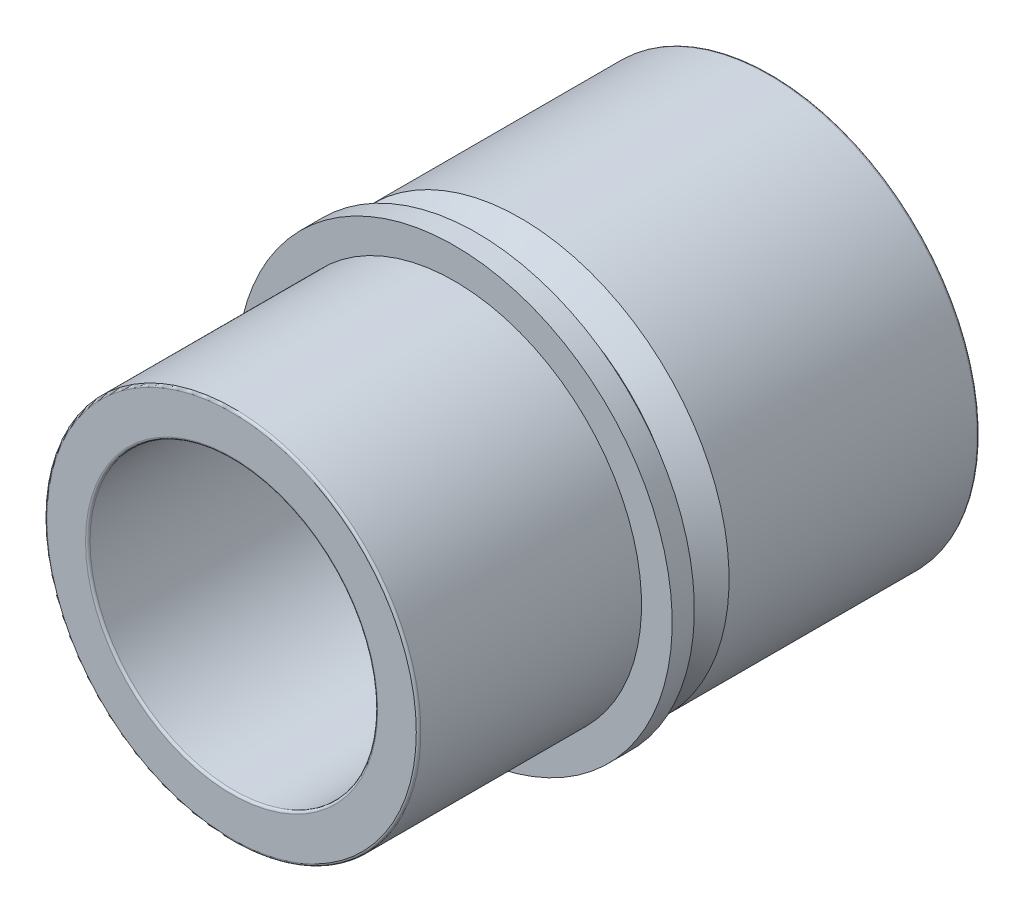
ISO-10303-21;
HEADER;
FILE_DESCRIPTION(('STEP AP214'),'2;1');
FILE_NAME('part.step','',(''),(''),'','','');
FILE_SCHEMA(('AUTOMOTIVE_DESIGN { 1 0 10303 214 1 1 1 1 }'));
ENDSEC;
DATA;
#1=APPLICATION_CONTEXT('core data for automotive mechanical design processes');
#2=APPLICATION_PROTOCOL_DEFINITION('international standard','automotive_design',2000,#1);
#3=PRODUCT_CONTEXT('',#1,'mechanical');
#4=PRODUCT('Part','Part','',(#3));
#5=PRODUCT_RELATED_PRODUCT_CATEGORY('part','',(#4));
#6=PRODUCT_DEFINITION_FORMATION('','',#4);
#7=PRODUCT_DEFINITION_CONTEXT('part definition',#1,'design');
#8=PRODUCT_DEFINITION('design','',#6,#7);
#9=PRODUCT_DEFINITION_SHAPE('','',#8);
#10=(LENGTH_UNIT() NAMED_UNIT(*) SI_UNIT(.MILLI.,.METRE.));
#11=(NAMED_UNIT(*) PLANE_ANGLE_UNIT() SI_UNIT($,.RADIAN.));
#12=(NAMED_UNIT(*) SI_UNIT($,.STERADIAN.) SOLID_ANGLE_UNIT());
#13=UNCERTAINTY_MEASURE_WITH_UNIT(LENGTH_MEASURE(1.E-05),#10,'distance_accuracy_value','');
#14=(GEOMETRIC_REPRESENTATION_CONTEXT(3) GLOBAL_UNCERTAINTY_ASSIGNED_CONTEXT((#13)) GLOBAL_UNIT_ASSIGNED_CONTEXT((#10,
#11,#12)) REPRESENTATION_CONTEXT('',''));
#15=CARTESIAN_POINT('',(0.,0.,0.));
#16=DIRECTION('',(0.,0.,1.));
#17=DIRECTION('',(1.,0.,0.));
#18=AXIS2_PLACEMENT_3D('',#15,#16,#17);
#19=CARTESIAN_POINT('',(0.,0.,-9.80439999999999));
#20=DIRECTION('',(0.,0.,-1.));
#21=DIRECTION('',(-1.,0.,0.));
#22=AXIS2_PLACEMENT_3D('',#19,#20,#21);
#23=CONICAL_SURFACE('',#22,41.275,0.78539816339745);
#24=CARTESIAN_POINT('',(0.,0.,-14.5669));
#25=DIRECTION('',(0.,0.,-1.));
#26=DIRECTION('',(-1.,0.,0.));
#27=AXIS2_PLACEMENT_3D('',#24,#25,#26);
#28=CIRCLE('',#27,46.0375);
#29=CARTESIAN_POINT('',(-46.0375,0.,-14.5669));
#30=VERTEX_POINT('',#29);
#31=EDGE_CURVE('E10',#30,#30,#28,.T.);
#32=ORIENTED_EDGE('',*,*,#31,.F.);
#33=EDGE_LOOP('',(#32));
#34=FACE_BOUND('',#33,.T.);
#35=CARTESIAN_POINT('',(0.,0.,-9.80439999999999));
#36=DIRECTION('',(0.,0.,-1.));
#37=DIRECTION('',(-1.,0.,0.));
#38=AXIS2_PLACEMENT_3D('',#35,#36,#37);
#39=CIRCLE('',#38,41.275);
#40=CARTESIAN_POINT('',(-41.275,0.,-9.8044));
#41=VERTEX_POINT('',#40);
#42=EDGE_CURVE('E106',#41,#41,#39,.T.);
#43=ORIENTED_EDGE('',*,*,#42,.T.);
#44=EDGE_LOOP('',(#43));
#45=FACE_BOUND('',#44,.T.);
#46=ADVANCED_FACE('F45',(#34,#45),#23,.T.);
#47=CARTESIAN_POINT('',(0.,0.,-41.5372037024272));
#48=DIRECTION('',(0.,0.,-1.));
#49=DIRECTION('',(-1.,0.,0.));
#50=AXIS2_PLACEMENT_3D('',#47,#48,#49);
#51=CYLINDRICAL_SURFACE('',#50,46.0375);
#52=CARTESIAN_POINT('',(0.,0.,-69.342));
#53=DIRECTION('',(0.,0.,-1.));
#54=DIRECTION('',(-1.,0.,0.));
#55=AXIS2_PLACEMENT_3D('',#52,#53,#54);
#56=CIRCLE('',#55,46.0375);
#57=CARTESIAN_POINT('',(-46.0375,0.,-69.342));
#58=VERTEX_POINT('',#57);
#59=EDGE_CURVE('E52',#58,#58,#56,.T.);
#60=ORIENTED_EDGE('',*,*,#59,.F.);
#61=EDGE_LOOP('',(#60));
#62=FACE_BOUND('',#61,.T.);
#63=ORIENTED_EDGE('',*,*,#31,.T.);
#64=EDGE_LOOP('',(#63));
#65=FACE_BOUND('',#64,.T.);
#66=ADVANCED_FACE('F181',(#62,#65),#51,.T.);
#67=CARTESIAN_POINT('',(0.,0.,-69.342));
#68=DIRECTION('',(0.,0.,-1.));
#69=DIRECTION('',(-1.,0.,0.));
#70=AXIS2_PLACEMENT_3D('',#67,#68,#69);
#71=TOROIDAL_SURFACE('',#70,45.5295,0.508000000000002);
#72=CARTESIAN_POINT('',(0.,0.,-69.85));
#73=DIRECTION('',(0.,0.,-1.));
#74=DIRECTION('',(-1.,0.,0.));
#75=AXIS2_PLACEMENT_3D('',#72,#73,#74);
#76=CIRCLE('',#75,45.5295);
#77=CARTESIAN_POINT('',(-45.5295,0.,-69.85));
#78=VERTEX_POINT('',#77);
#79=EDGE_CURVE('E58',#78,#78,#76,.T.);
#80=ORIENTED_EDGE('',*,*,#79,.F.);
#81=EDGE_LOOP('',(#80));
#82=FACE_BOUND('',#81,.T.);
#83=ORIENTED_EDGE('',*,*,#59,.T.);
#84=EDGE_LOOP('',(#83));
#85=FACE_BOUND('',#84,.T.);
#86=ADVANCED_FACE('F176',(#82,#85),#71,.T.);
#87=CARTESIAN_POINT('',(-45.5295,0.,-69.85));
#88=DIRECTION('',(0.,0.,1.));
#89=DIRECTION('',(1.,0.,0.));
#90=AXIS2_PLACEMENT_3D('',#87,#88,#89);
#91=PLANE('',#90);
#92=CARTESIAN_POINT('',(0.,0.,-69.85));
#93=DIRECTION('',(0.,0.,-1.));
#94=DIRECTION('',(-1.,0.,0.));
#95=AXIS2_PLACEMENT_3D('',#92,#93,#94);
#96=CIRCLE('',#95,32.258);
#97=CARTESIAN_POINT('',(-32.258,0.,-69.85));
#98=VERTEX_POINT('',#97);
#99=EDGE_CURVE('E64',#98,#98,#96,.T.);
#100=ORIENTED_EDGE('',*,*,#99,.F.);
#101=EDGE_LOOP('',(#100));
#102=FACE_BOUND('',#101,.T.);
#103=ORIENTED_EDGE('',*,*,#79,.T.);
#104=EDGE_LOOP('',(#103));
#105=FACE_BOUND('',#104,.T.);
#106=ADVANCED_FACE('F170',(#102,#105),#91,.F.);
#107=CARTESIAN_POINT('',(0.,0.,-69.342));
#108=DIRECTION('',(0.,0.,-1.));
#109=DIRECTION('',(-1.,0.,0.));
#110=AXIS2_PLACEMENT_3D('',#107,#108,#109);
#111=TOROIDAL_SURFACE('',#110,32.258,0.508000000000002);
#112=CARTESIAN_POINT('',(0.,0.,-69.342));
#113=DIRECTION('',(0.,0.,-1.));
#114=DIRECTION('',(-1.,0.,0.));
#115=AXIS2_PLACEMENT_3D('',#112,#113,#114);
#116=CIRCLE('',#115,31.75);
#117=CARTESIAN_POINT('',(-31.75,0.,-69.342));
#118=VERTEX_POINT('',#117);
#119=EDGE_CURVE('E70',#118,#118,#116,.T.);
#120=ORIENTED_EDGE('',*,*,#119,.F.);
#121=EDGE_LOOP('',(#120));
#122=FACE_BOUND('',#121,.T.);
#123=ORIENTED_EDGE('',*,*,#99,.T.);
#124=EDGE_LOOP('',(#123));
#125=FACE_BOUND('',#124,.T.);
#126=ADVANCED_FACE('F164',(#122,#125),#111,.T.);
#127=CARTESIAN_POINT('',(0.,0.,-41.5372037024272));
#128=DIRECTION('',(0.,0.,-1.));
#129=DIRECTION('',(-1.,0.,0.));
#130=AXIS2_PLACEMENT_3D('',#127,#128,#129);
#131=CYLINDRICAL_SURFACE('',#130,31.75);
#132=CARTESIAN_POINT('',(0.,0.,48.7045));
#133=DIRECTION('',(0.,0.,-1.));
#134=DIRECTION('',(-1.,0.,0.));
#135=AXIS2_PLACEMENT_3D('',#132,#133,#134);
#136=CIRCLE('',#135,31.75);
#137=CARTESIAN_POINT('',(-31.75,0.,48.7045));
#138=VERTEX_POINT('',#137);
#139=EDGE_CURVE('E74',#138,#138,#136,.T.);
#140=ORIENTED_EDGE('',*,*,#139,.F.);
#141=EDGE_LOOP('',(#140));
#142=FACE_BOUND('',#141,.T.);
#143=ORIENTED_EDGE('',*,*,#119,.T.);
#144=EDGE_LOOP('',(#143));
#145=FACE_BOUND('',#144,.T.);
#146=ADVANCED_FACE('F158',(#142,#145),#131,.F.);
#147=CARTESIAN_POINT('',(0.,0.,48.7045));
#148=DIRECTION('',(0.,0.,-1.));
#149=DIRECTION('',(-1.,0.,0.));
#150=AXIS2_PLACEMENT_3D('',#147,#148,#149);
#151=TOROIDAL_SURFACE('',#150,32.258,0.508000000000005);
#152=CARTESIAN_POINT('',(0.,0.,49.2125));
#153=DIRECTION('',(0.,0.,-1.));
#154=DIRECTION('',(-1.,0.,0.));
#155=AXIS2_PLACEMENT_3D('',#152,#153,#154);
#156=CIRCLE('',#155,32.258);
#157=CARTESIAN_POINT('',(-32.258,0.,49.2125));
#158=VERTEX_POINT('',#157);
#159=EDGE_CURVE('E78',#158,#158,#156,.T.);
#160=ORIENTED_EDGE('',*,*,#159,.F.);
#161=EDGE_LOOP('',(#160));
#162=FACE_BOUND('',#161,.T.);
#163=ORIENTED_EDGE('',*,*,#139,.T.);
#164=EDGE_LOOP('',(#163));
#165=FACE_BOUND('',#164,.T.);
#166=ADVANCED_FACE('F152',(#162,#165),#151,.T.);
#167=CARTESIAN_POINT('',(-32.2579999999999,0.,49.2125));
#168=DIRECTION('',(0.,0.,-1.));
#169=DIRECTION('',(-1.,0.,0.));
#170=AXIS2_PLACEMENT_3D('',#167,#168,#169);
#171=PLANE('',#170);
#172=CARTESIAN_POINT('',(0.,0.,49.2125));
#173=DIRECTION('',(0.,0.,-1.));
#174=DIRECTION('',(-1.,0.,0.));
#175=AXIS2_PLACEMENT_3D('',#172,#173,#174);
#176=CIRCLE('',#175,40.767);
#177=CARTESIAN_POINT('',(-40.767,0.,49.2125));
#178=VERTEX_POINT('',#177);
#179=EDGE_CURVE('E82',#178,#178,#176,.T.);
#180=ORIENTED_EDGE('',*,*,#179,.F.);
#181=EDGE_LOOP('',(#180));
#182=FACE_BOUND('',#181,.T.);
#183=ORIENTED_EDGE('',*,*,#159,.T.);
#184=EDGE_LOOP('',(#183));
#185=FACE_BOUND('',#184,.T.);
#186=ADVANCED_FACE('F146',(#182,#185),#171,.F.);
#187=CARTESIAN_POINT('',(0.,0.,48.7045));
#188=DIRECTION('',(0.,0.,-1.));
#189=DIRECTION('',(-1.,0.,0.));
#190=AXIS2_PLACEMENT_3D('',#187,#188,#189);
#191=TOROIDAL_SURFACE('',#190,40.767,0.508000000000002);
#192=CARTESIAN_POINT('',(0.,0.,48.7045));
#193=DIRECTION('',(0.,0.,-1.));
#194=DIRECTION('',(-1.,0.,0.));
#195=AXIS2_PLACEMENT_3D('',#192,#193,#194);
#196=CIRCLE('',#195,41.275);
#197=CARTESIAN_POINT('',(-41.275,0.,48.7045));
#198=VERTEX_POINT('',#197);
#199=EDGE_CURVE('E86',#198,#198,#196,.T.);
#200=ORIENTED_EDGE('',*,*,#199,.F.);
#201=EDGE_LOOP('',(#200));
#202=FACE_BOUND('',#201,.T.);
#203=ORIENTED_EDGE('',*,*,#179,.T.);
#204=EDGE_LOOP('',(#203));
#205=FACE_BOUND('',#204,.T.);
#206=ADVANCED_FACE('F140',(#202,#205),#191,.T.);
#207=CARTESIAN_POINT('',(0.,0.,-41.5372037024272));
#208=DIRECTION('',(0.,0.,-1.));
#209=DIRECTION('',(-1.,0.,0.));
#210=AXIS2_PLACEMENT_3D('',#207,#208,#209);
#211=CYLINDRICAL_SURFACE('',#210,41.275);
#212=CARTESIAN_POINT('',(0.,0.,0.));
#213=DIRECTION('',(0.,0.,-1.));
#214=DIRECTION('',(-1.,0.,0.));
#215=AXIS2_PLACEMENT_3D('',#212,#213,#214);
#216=CIRCLE('',#215,41.275);
#217=CARTESIAN_POINT('',(-41.275,0.,0.));
#218=VERTEX_POINT('',#217);
#219=EDGE_CURVE('E90',#218,#218,#216,.T.);
#220=ORIENTED_EDGE('',*,*,#219,.F.);
#221=EDGE_LOOP('',(#220));
#222=FACE_BOUND('',#221,.T.);
#223=ORIENTED_EDGE('',*,*,#199,.T.);
#224=EDGE_LOOP('',(#223));
#225=FACE_BOUND('',#224,.T.);
#226=ADVANCED_FACE('F134',(#222,#225),#211,.T.);
#227=CARTESIAN_POINT('',(-41.2749999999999,0.,0.));
#228=DIRECTION('',(0.,0.,-1.));
#229=DIRECTION('',(-1.,0.,0.));
#230=AXIS2_PLACEMENT_3D('',#227,#228,#229);
#231=PLANE('',#230);
#232=CARTESIAN_POINT('',(0.,0.,0.));
#233=DIRECTION('',(0.,0.,-1.));
#234=DIRECTION('',(-1.,0.,0.));
#235=AXIS2_PLACEMENT_3D('',#232,#233,#234);
#236=CIRCLE('',#235,48.0441);
#237=CARTESIAN_POINT('',(-48.0441,0.,0.));
#238=VERTEX_POINT('',#237);
#239=EDGE_CURVE('E94',#238,#238,#236,.T.);
#240=ORIENTED_EDGE('',*,*,#239,.F.);
#241=EDGE_LOOP('',(#240));
#242=FACE_BOUND('',#241,.T.);
#243=ORIENTED_EDGE('',*,*,#219,.T.);
#244=EDGE_LOOP('',(#243));
#245=FACE_BOUND('',#244,.T.);
#246=ADVANCED_FACE('F128',(#242,#245),#231,.F.);
#247=CARTESIAN_POINT('',(0.,0.,-41.5372037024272));
#248=DIRECTION('',(0.,0.,-1.));
#249=DIRECTION('',(-1.,0.,0.));
#250=AXIS2_PLACEMENT_3D('',#247,#248,#249);
#251=CYLINDRICAL_SURFACE('',#250,48.0441);
#252=CARTESIAN_POINT('',(0.,0.,-4.9022));
#253=DIRECTION('',(0.,0.,-1.));
#254=DIRECTION('',(-1.,0.,0.));
#255=AXIS2_PLACEMENT_3D('',#252,#253,#254);
#256=CIRCLE('',#255,48.0441);
#257=CARTESIAN_POINT('',(-48.0441,0.,-4.9022));
#258=VERTEX_POINT('',#257);
#259=EDGE_CURVE('E98',#258,#258,#256,.T.);
#260=ORIENTED_EDGE('',*,*,#259,.F.);
#261=EDGE_LOOP('',(#260));
#262=FACE_BOUND('',#261,.T.);
#263=ORIENTED_EDGE('',*,*,#239,.T.);
#264=EDGE_LOOP('',(#263));
#265=FACE_BOUND('',#264,.T.);
#266=ADVANCED_FACE('F122',(#262,#265),#251,.T.);
#267=CARTESIAN_POINT('',(-48.0441,0.,-4.9022));
#268=DIRECTION('',(0.,0.,1.));
#269=DIRECTION('',(1.,0.,0.));
#270=AXIS2_PLACEMENT_3D('',#267,#268,#269);
#271=PLANE('',#270);
#272=CARTESIAN_POINT('',(0.,0.,-4.9022));
#273=DIRECTION('',(0.,0.,-1.));
#274=DIRECTION('',(-1.,0.,0.));
#275=AXIS2_PLACEMENT_3D('',#272,#273,#274);
#276=CIRCLE('',#275,41.275);
#277=CARTESIAN_POINT('',(-41.275,0.,-4.9022));
#278=VERTEX_POINT('',#277);
#279=EDGE_CURVE('E102',#278,#278,#276,.T.);
#280=ORIENTED_EDGE('',*,*,#279,.F.);
#281=EDGE_LOOP('',(#280));
#282=FACE_BOUND('',#281,.T.);
#283=ORIENTED_EDGE('',*,*,#259,.T.);
#284=EDGE_LOOP('',(#283));
#285=FACE_BOUND('',#284,.T.);
#286=ADVANCED_FACE('F116',(#282,#285),#271,.F.);
#287=CARTESIAN_POINT('',(0.,0.,-41.5372037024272));
#288=DIRECTION('',(0.,0.,-1.));
#289=DIRECTION('',(-1.,0.,0.));
#290=AXIS2_PLACEMENT_3D('',#287,#288,#289);
#291=CYLINDRICAL_SURFACE('',#290,41.275);
#292=ORIENTED_EDGE('',*,*,#42,.F.);
#293=EDGE_LOOP('',(#292));
#294=FACE_BOUND('',#293,.T.);
#295=ORIENTED_EDGE('',*,*,#279,.T.);
#296=EDGE_LOOP('',(#295));
#297=FACE_BOUND('',#296,.T.);
#298=ADVANCED_FACE('F113',(#294,#297),#291,.T.);
#299=CLOSED_SHELL('',(#46,#66,#86,#106,#126,#146,#166,#186,#206,#226,#246,#266,#286,#298));
#300=MANIFOLD_SOLID_BREP('B2',#299);
#301=ADVANCED_BREP_SHAPE_REPRESENTATION('',(#18,#300),#14);
#302=SHAPE_DEFINITION_REPRESENTATION(#9,#301);
ENDSEC;
END-ISO-10303-21;
